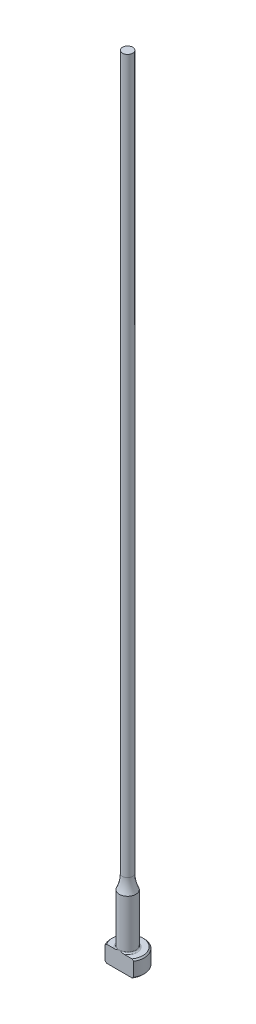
from build123d import *

# Parameters (mm, degrees)
CHAMFER1_SIZE = 0.254
FILLET1_R     = 0.254
KEY_DEPTH     = 153.466131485


with BuildPart() as part:
    # Sketch1 → Revolve1 (revolve)
    with BuildSketch(Plane.XY, mode=Mode.PRIVATE) as revolve1_sk:
        with BuildLine():
            Line((0, 0), (-3.175, 0))
            Line((-3.175, 0), (-3.175, 3.175))
            Line((-3.175, 3.175), (-1.5875, 3.175))
            Line((-1.5875, 3.175), (-1.5875, 12.7))
            ThreePointArc((-1.5875, 12.7), (-1.142565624, 14.009911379), (-0.99187, 15.385093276))
            Line((-0.99187, 15.385093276), (-0.99187, 152.4))
            Line((-0.99187, 152.4), (0, 152.4))
            Line((0, 152.4), (0, 0))
        make_face()
    revolve(revolve1_sk.sketch.rotate(Axis((0, 259.958771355, 0), (0, -1, 0)), 270), axis=Axis((0, 259.958771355, 0), (0, -1, 0)))

    # Chamfer1
    chamfer1_edges = [part.edges().sort_by_distance(p)[0] for p in [
        (0, 0, -3.175),
        (0, 3.175, -3.175),
    ]]
    chamfer(chamfer1_edges, length=CHAMFER1_SIZE)

    # Fillet1
    fillet1_edges = [part.edges().sort_by_distance(p)[0] for p in [
        (0, 3.175, -1.5875),
    ]]
    fillet(fillet1_edges, radius=FILLET1_R)

    # Sketch2 → KEY (cut, through all)
    with BuildSketch(Plane.XZ):
        with BuildLine():
            Line((-2.749630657, 1.5875), (2.749630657, 1.5875))
            ThreePointArc((2.749630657, 1.5875), (0, 3.175), (-2.749630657, 1.5875))
        make_face()
    extrude(amount=-KEY_DEPTH, mode=Mode.SUBTRACT)


solid = part.part
